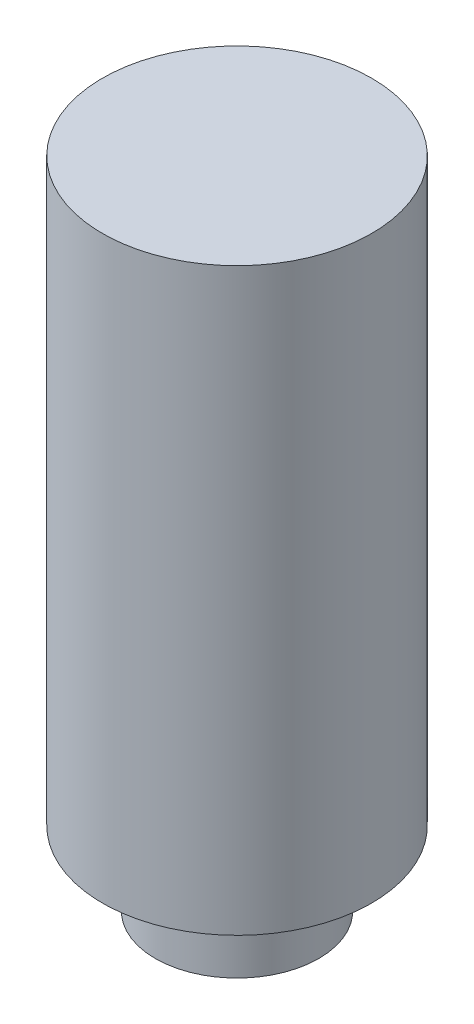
from build123d import *


with BuildPart() as part:
    # Sketch2 → Revolve1 (revolve)
    with BuildSketch(Plane(origin=(0, 0, 0), x_dir=(0, 0, -1), z_dir=(1, 0, 0))):
        Polygon((2.2987, 11.176), (2.2987, 1.27), (1.27, 1.27), (1.27, 0.762), (1.397, 0.762), (1.397, 0), (0, 0), (0, 11.176), align=None)
    revolve(axis=Axis((0, 0, 0), (0, 1, 0)))


solid = part.part
